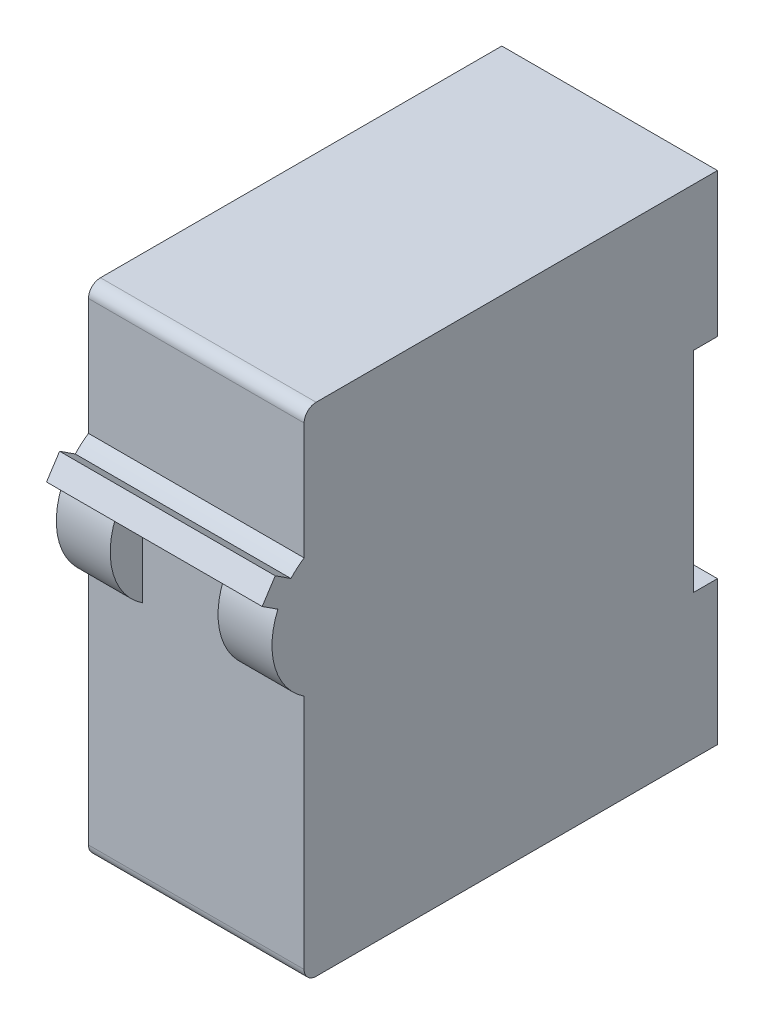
ISO-10303-21;
HEADER;
FILE_DESCRIPTION(('STEP AP214'),'2;1');
FILE_NAME('part.step','',(''),(''),'','','');
FILE_SCHEMA(('AUTOMOTIVE_DESIGN { 1 0 10303 214 1 1 1 1 }'));
ENDSEC;
DATA;
#1=APPLICATION_CONTEXT('core data for automotive mechanical design processes');
#2=APPLICATION_PROTOCOL_DEFINITION('international standard','automotive_design',2000,#1);
#3=PRODUCT_CONTEXT('',#1,'mechanical');
#4=PRODUCT('Part','Part','',(#3));
#5=PRODUCT_RELATED_PRODUCT_CATEGORY('part','',(#4));
#6=PRODUCT_DEFINITION_FORMATION('','',#4);
#7=PRODUCT_DEFINITION_CONTEXT('part definition',#1,'design');
#8=PRODUCT_DEFINITION('design','',#6,#7);
#9=PRODUCT_DEFINITION_SHAPE('','',#8);
#10=(LENGTH_UNIT() NAMED_UNIT(*) SI_UNIT(.MILLI.,.METRE.));
#11=(NAMED_UNIT(*) PLANE_ANGLE_UNIT() SI_UNIT($,.RADIAN.));
#12=(NAMED_UNIT(*) SI_UNIT($,.STERADIAN.) SOLID_ANGLE_UNIT());
#13=UNCERTAINTY_MEASURE_WITH_UNIT(LENGTH_MEASURE(1.E-05),#10,'distance_accuracy_value','');
#14=(GEOMETRIC_REPRESENTATION_CONTEXT(3) GLOBAL_UNCERTAINTY_ASSIGNED_CONTEXT((#13)) GLOBAL_UNIT_ASSIGNED_CONTEXT((#10,
#11,#12)) REPRESENTATION_CONTEXT('',''));
#15=CARTESIAN_POINT('',(0.,0.,0.));
#16=DIRECTION('',(0.,0.,1.));
#17=DIRECTION('',(1.,0.,0.));
#18=AXIS2_PLACEMENT_3D('',#15,#16,#17);
#19=CARTESIAN_POINT('',(36.,51.5,62.3667504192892));
#20=DIRECTION('',(-1.,0.,0.));
#21=DIRECTION('',(0.,0.,1.));
#22=AXIS2_PLACEMENT_3D('',#19,#20,#21);
#23=CYLINDRICAL_SURFACE('',#22,12.);
#24=CARTESIAN_POINT('',(27.,51.5,62.3667504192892));
#25=DIRECTION('',(-1.,0.,0.));
#26=DIRECTION('',(0.,-1.,0.));
#27=AXIS2_PLACEMENT_3D('',#24,#25,#26);
#28=CIRCLE('',#27,12.);
#29=CARTESIAN_POINT('',(27.,41.5,69.));
#30=VERTEX_POINT('',#29);
#31=CARTESIAN_POINT('',(27.,56.2669148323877,73.3793124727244));
#32=VERTEX_POINT('',#31);
#33=EDGE_CURVE('E11',#30,#32,#28,.T.);
#34=ORIENTED_EDGE('',*,*,#33,.F.);
#35=DIRECTION('',(-1.,0.,0.));
#36=VECTOR('',#35,1.);
#37=CARTESIAN_POINT('',(36.,41.5,69.));
#38=LINE('',#37,#36);
#39=CARTESIAN_POINT('',(36.,41.5,69.));
#40=VERTEX_POINT('',#39);
#41=EDGE_CURVE('E190',#40,#30,#38,.T.);
#42=ORIENTED_EDGE('',*,*,#41,.F.);
#43=CARTESIAN_POINT('',(36.,51.5,62.3667504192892));
#44=DIRECTION('',(1.,0.,0.));
#45=DIRECTION('',(0.,0.,-1.));
#46=AXIS2_PLACEMENT_3D('',#43,#44,#45);
#47=CIRCLE('',#46,12.);
#48=CARTESIAN_POINT('',(36.,56.2669148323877,73.3793124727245));
#49=VERTEX_POINT('',#48);
#50=EDGE_CURVE('E208',#49,#40,#47,.T.);
#51=ORIENTED_EDGE('',*,*,#50,.F.);
#52=DIRECTION('',(-1.,0.,0.));
#53=VECTOR('',#52,1.);
#54=CARTESIAN_POINT('',(36.,56.2669148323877,73.3793124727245));
#55=LINE('',#54,#53);
#56=EDGE_CURVE('E275',#49,#32,#55,.T.);
#57=ORIENTED_EDGE('',*,*,#56,.T.);
#58=EDGE_LOOP('',(#34,#42,#51,#57));
#59=FACE_BOUND('',#58,.T.);
#60=ADVANCED_FACE('F39',(#59),#23,.T.);
#61=CARTESIAN_POINT('',(9.,51.5,62.3667504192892));
#62=DIRECTION('',(1.,0.,0.));
#63=DIRECTION('',(0.,0.,-1.));
#64=AXIS2_PLACEMENT_3D('',#61,#62,#63);
#65=CIRCLE('',#64,12.);
#66=CARTESIAN_POINT('',(9.,56.2669148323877,73.3793124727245));
#67=VERTEX_POINT('',#66);
#68=CARTESIAN_POINT('',(9.,41.5,69.));
#69=VERTEX_POINT('',#68);
#70=EDGE_CURVE('E47',#67,#69,#65,.T.);
#71=ORIENTED_EDGE('',*,*,#70,.F.);
#72=CARTESIAN_POINT('',(0.,56.2669148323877,73.3793124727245));
#73=VERTEX_POINT('',#72);
#74=EDGE_CURVE('E274',#67,#73,#55,.T.);
#75=ORIENTED_EDGE('',*,*,#74,.T.);
#76=CARTESIAN_POINT('',(0.,51.5,62.3667504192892));
#77=DIRECTION('',(1.,0.,0.));
#78=DIRECTION('',(0.,0.,-1.));
#79=AXIS2_PLACEMENT_3D('',#76,#77,#78);
#80=CIRCLE('',#79,12.);
#81=CARTESIAN_POINT('',(0.,41.5,69.));
#82=VERTEX_POINT('',#81);
#83=EDGE_CURVE('E239',#73,#82,#80,.T.);
#84=ORIENTED_EDGE('',*,*,#83,.T.);
#85=EDGE_CURVE('E272',#69,#82,#38,.T.);
#86=ORIENTED_EDGE('',*,*,#85,.F.);
#87=EDGE_LOOP('',(#71,#75,#84,#86));
#88=FACE_BOUND('',#87,.T.);
#89=ADVANCED_FACE('F313',(#88),#23,.T.);
#90=CARTESIAN_POINT('',(36.,83.,0.));
#91=DIRECTION('',(0.,-1.,0.));
#92=DIRECTION('',(0.,0.,-1.));
#93=AXIS2_PLACEMENT_3D('',#90,#91,#92);
#94=PLANE('',#93);
#95=DIRECTION('',(0.,0.,1.));
#96=VECTOR('',#95,1.);
#97=CARTESIAN_POINT('',(0.,83.,0.));
#98=LINE('',#97,#96);
#99=CARTESIAN_POINT('',(0.,83.,0.));
#100=VERTEX_POINT('',#99);
#101=CARTESIAN_POINT('',(0.,83.,67.));
#102=VERTEX_POINT('',#101);
#103=EDGE_CURVE('E178',#100,#102,#98,.T.);
#104=ORIENTED_EDGE('',*,*,#103,.T.);
#105=DIRECTION('',(-1.,0.,0.));
#106=VECTOR('',#105,1.);
#107=CARTESIAN_POINT('',(36.,83.,67.));
#108=LINE('',#107,#106);
#109=CARTESIAN_POINT('',(36.,83.,67.));
#110=VERTEX_POINT('',#109);
#111=EDGE_CURVE('E306',#102,#110,#108,.F.);
#112=ORIENTED_EDGE('',*,*,#111,.T.);
#113=DIRECTION('',(0.,0.,1.));
#114=VECTOR('',#113,1.);
#115=CARTESIAN_POINT('',(36.,83.,0.));
#116=LINE('',#115,#114);
#117=CARTESIAN_POINT('',(36.,83.,0.));
#118=VERTEX_POINT('',#117);
#119=EDGE_CURVE('E195',#118,#110,#116,.T.);
#120=ORIENTED_EDGE('',*,*,#119,.F.);
#121=DIRECTION('',(-1.,0.,0.));
#122=VECTOR('',#121,1.);
#123=CARTESIAN_POINT('',(36.,83.,0.));
#124=LINE('',#123,#122);
#125=EDGE_CURVE('E225',#118,#100,#124,.T.);
#126=ORIENTED_EDGE('',*,*,#125,.T.);
#127=EDGE_LOOP('',(#104,#112,#120,#126));
#128=FACE_BOUND('',#127,.T.);
#129=ADVANCED_FACE('F356',(#128),#94,.F.);
#130=CARTESIAN_POINT('',(36.,83.,69.));
#131=DIRECTION('',(0.,0.,-1.));
#132=DIRECTION('',(0.,1.,0.));
#133=AXIS2_PLACEMENT_3D('',#130,#131,#132);
#134=PLANE('',#133);
#135=DIRECTION('',(0.,-1.,0.));
#136=VECTOR('',#135,1.);
#137=CARTESIAN_POINT('',(36.,83.,69.));
#138=LINE('',#137,#136);
#139=CARTESIAN_POINT('',(36.,81.,69.));
#140=VERTEX_POINT('',#139);
#141=CARTESIAN_POINT('',(36.,61.5,69.));
#142=VERTEX_POINT('',#141);
#143=EDGE_CURVE('E197',#140,#142,#138,.T.);
#144=ORIENTED_EDGE('',*,*,#143,.F.);
#145=DIRECTION('',(-1.,0.,0.));
#146=VECTOR('',#145,1.);
#147=CARTESIAN_POINT('',(36.,81.,69.));
#148=LINE('',#147,#146);
#149=CARTESIAN_POINT('',(0.,81.,69.));
#150=VERTEX_POINT('',#149);
#151=EDGE_CURVE('E303',#140,#150,#148,.T.);
#152=ORIENTED_EDGE('',*,*,#151,.T.);
#153=DIRECTION('',(0.,-1.,0.));
#154=VECTOR('',#153,1.);
#155=CARTESIAN_POINT('',(0.,83.,69.));
#156=LINE('',#155,#154);
#157=CARTESIAN_POINT('',(0.,61.5,69.));
#158=VERTEX_POINT('',#157);
#159=EDGE_CURVE('E228',#150,#158,#156,.T.);
#160=ORIENTED_EDGE('',*,*,#159,.T.);
#161=DIRECTION('',(-1.,0.,0.));
#162=VECTOR('',#161,1.);
#163=CARTESIAN_POINT('',(36.,61.5,69.));
#164=LINE('',#163,#162);
#165=EDGE_CURVE('E288',#142,#158,#164,.T.);
#166=ORIENTED_EDGE('',*,*,#165,.F.);
#167=EDGE_LOOP('',(#144,#152,#160,#166));
#168=FACE_BOUND('',#167,.T.);
#169=ADVANCED_FACE('F362',(#168),#134,.F.);
#170=CARTESIAN_POINT('',(36.,51.5,62.3667504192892));
#171=DIRECTION('',(-1.,0.,0.));
#172=DIRECTION('',(0.,0.,1.));
#173=AXIS2_PLACEMENT_3D('',#170,#171,#172);
#174=CYLINDRICAL_SURFACE('',#173,12.);
#175=CARTESIAN_POINT('',(0.,51.5,62.3667504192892));
#176=DIRECTION('',(1.,0.,0.));
#177=DIRECTION('',(0.,0.,1.));
#178=AXIS2_PLACEMENT_3D('',#175,#176,#177);
#179=CIRCLE('',#178,12.);
#180=CARTESIAN_POINT('',(0.,59.6215971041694,71.2007563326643));
#181=VERTEX_POINT('',#180);
#182=EDGE_CURVE('E230',#158,#181,#179,.T.);
#183=ORIENTED_EDGE('',*,*,#182,.T.);
#184=DIRECTION('',(-1.,0.,0.));
#185=VECTOR('',#184,1.);
#186=CARTESIAN_POINT('',(36.,59.6215971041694,71.2007563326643));
#187=LINE('',#186,#185);
#188=CARTESIAN_POINT('',(36.,59.6215971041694,71.2007563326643));
#189=VERTEX_POINT('',#188);
#190=EDGE_CURVE('E285',#189,#181,#187,.T.);
#191=ORIENTED_EDGE('',*,*,#190,.F.);
#192=CARTESIAN_POINT('',(36.,51.5,62.3667504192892));
#193=DIRECTION('',(1.,0.,0.));
#194=DIRECTION('',(0.,0.,1.));
#195=AXIS2_PLACEMENT_3D('',#192,#193,#194);
#196=CIRCLE('',#195,12.);
#197=EDGE_CURVE('E200',#142,#189,#196,.T.);
#198=ORIENTED_EDGE('',*,*,#197,.F.);
#199=ORIENTED_EDGE('',*,*,#165,.T.);
#200=EDGE_LOOP('',(#183,#191,#198,#199));
#201=FACE_BOUND('',#200,.T.);
#202=ADVANCED_FACE('F370',(#201),#174,.T.);
#203=CARTESIAN_POINT('',(36.,59.6215971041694,71.2007563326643));
#204=DIRECTION('',(0.,-0.838670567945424,0.544639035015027));
#205=DIRECTION('',(0.,-0.544639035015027,-0.838670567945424));
#206=AXIS2_PLACEMENT_3D('',#203,#204,#205);
#207=PLANE('',#206);
#208=DIRECTION('',(0.,0.544639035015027,0.838670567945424));
#209=VECTOR('',#208,1.);
#210=CARTESIAN_POINT('',(0.,59.6215971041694,71.2007563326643));
#211=LINE('',#210,#209);
#212=CARTESIAN_POINT('',(0.,61.3234914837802,73.8214438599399));
#213=VERTEX_POINT('',#212);
#214=EDGE_CURVE('E232',#181,#213,#211,.T.);
#215=ORIENTED_EDGE('',*,*,#214,.T.);
#216=DIRECTION('',(-1.,0.,0.));
#217=VECTOR('',#216,1.);
#218=CARTESIAN_POINT('',(36.,61.3234914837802,73.8214438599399));
#219=LINE('',#218,#217);
#220=CARTESIAN_POINT('',(36.,61.3234914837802,73.8214438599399));
#221=VERTEX_POINT('',#220);
#222=EDGE_CURVE('E282',#221,#213,#219,.T.);
#223=ORIENTED_EDGE('',*,*,#222,.F.);
#224=DIRECTION('',(0.,0.544639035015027,0.838670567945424));
#225=VECTOR('',#224,1.);
#226=CARTESIAN_POINT('',(36.,59.6215971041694,71.2007563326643));
#227=LINE('',#226,#225);
#228=EDGE_CURVE('E202',#189,#221,#227,.T.);
#229=ORIENTED_EDGE('',*,*,#228,.F.);
#230=ORIENTED_EDGE('',*,*,#190,.T.);
#231=EDGE_LOOP('',(#215,#223,#229,#230));
#232=FACE_BOUND('',#231,.T.);
#233=ADVANCED_FACE('F374',(#232),#207,.F.);
#234=CARTESIAN_POINT('',(36.,61.3234914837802,73.8214438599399));
#235=DIRECTION('',(0.,-0.544639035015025,-0.838670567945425));
#236=DIRECTION('',(0.,0.838670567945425,-0.544639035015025));
#237=AXIS2_PLACEMENT_3D('',#234,#235,#236);
#238=PLANE('',#237);
#239=DIRECTION('',(0.,-0.838670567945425,0.544639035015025));
#240=VECTOR('',#239,1.);
#241=CARTESIAN_POINT('',(0.,61.3234914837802,73.8214438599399));
#242=LINE('',#241,#240);
#243=CARTESIAN_POINT('',(0.,57.9688092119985,76.));
#244=VERTEX_POINT('',#243);
#245=EDGE_CURVE('E234',#213,#244,#242,.T.);
#246=ORIENTED_EDGE('',*,*,#245,.T.);
#247=DIRECTION('',(-1.,0.,0.));
#248=VECTOR('',#247,1.);
#249=CARTESIAN_POINT('',(36.,57.9688092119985,76.));
#250=LINE('',#249,#248);
#251=CARTESIAN_POINT('',(36.,57.9688092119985,76.));
#252=VERTEX_POINT('',#251);
#253=EDGE_CURVE('E278',#252,#244,#250,.T.);
#254=ORIENTED_EDGE('',*,*,#253,.F.);
#255=DIRECTION('',(0.,-0.838670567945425,0.544639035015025));
#256=VECTOR('',#255,1.);
#257=CARTESIAN_POINT('',(36.,61.3234914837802,73.8214438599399));
#258=LINE('',#257,#256);
#259=EDGE_CURVE('E204',#221,#252,#258,.T.);
#260=ORIENTED_EDGE('',*,*,#259,.F.);
#261=ORIENTED_EDGE('',*,*,#222,.T.);
#262=EDGE_LOOP('',(#246,#254,#260,#261));
#263=FACE_BOUND('',#262,.T.);
#264=ADVANCED_FACE('F381',(#263),#238,.F.);
#265=CARTESIAN_POINT('',(36.,57.9688092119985,76.));
#266=DIRECTION('',(0.,0.838670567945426,-0.544639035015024));
#267=DIRECTION('',(0.,0.544639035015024,0.838670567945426));
#268=AXIS2_PLACEMENT_3D('',#265,#266,#267);
#269=PLANE('',#268);
#270=DIRECTION('',(0.,-0.544639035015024,-0.838670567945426));
#271=VECTOR('',#270,1.);
#272=CARTESIAN_POINT('',(0.,57.9688092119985,76.));
#273=LINE('',#272,#271);
#274=EDGE_CURVE('E236',#244,#73,#273,.T.);
#275=ORIENTED_EDGE('',*,*,#274,.T.);
#276=ORIENTED_EDGE('',*,*,#74,.F.);
#277=EDGE_CURVE('E279',#32,#67,#55,.T.);
#278=ORIENTED_EDGE('',*,*,#277,.F.);
#279=ORIENTED_EDGE('',*,*,#56,.F.);
#280=DIRECTION('',(0.,-0.544639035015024,-0.838670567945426));
#281=VECTOR('',#280,1.);
#282=CARTESIAN_POINT('',(36.,57.9688092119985,76.));
#283=LINE('',#282,#281);
#284=EDGE_CURVE('E206',#252,#49,#283,.T.);
#285=ORIENTED_EDGE('',*,*,#284,.F.);
#286=ORIENTED_EDGE('',*,*,#253,.T.);
#287=EDGE_LOOP('',(#275,#276,#278,#279,#285,#286));
#288=FACE_BOUND('',#287,.T.);
#289=ADVANCED_FACE('F384',(#288),#269,.F.);
#290=CARTESIAN_POINT('',(36.,41.5,69.));
#291=DIRECTION('',(0.,0.,-1.));
#292=DIRECTION('',(-1.,0.,0.));
#293=AXIS2_PLACEMENT_3D('',#290,#291,#292);
#294=PLANE('',#293);
#295=DIRECTION('',(0.,-1.,0.));
#296=VECTOR('',#295,1.);
#297=CARTESIAN_POINT('',(0.,41.5,69.));
#298=LINE('',#297,#296);
#299=CARTESIAN_POINT('',(0.,2.00000000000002,69.));
#300=VERTEX_POINT('',#299);
#301=EDGE_CURVE('E242',#82,#300,#298,.T.);
#302=ORIENTED_EDGE('',*,*,#301,.T.);
#303=DIRECTION('',(-1.,0.,0.));
#304=VECTOR('',#303,1.);
#305=CARTESIAN_POINT('',(36.,2.,69.));
#306=LINE('',#305,#304);
#307=CARTESIAN_POINT('',(36.,2.00000000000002,69.));
#308=VERTEX_POINT('',#307);
#309=EDGE_CURVE('E298',#300,#308,#306,.F.);
#310=ORIENTED_EDGE('',*,*,#309,.T.);
#311=DIRECTION('',(0.,-1.,0.));
#312=VECTOR('',#311,1.);
#313=CARTESIAN_POINT('',(36.,41.5,69.));
#314=LINE('',#313,#312);
#315=EDGE_CURVE('E210',#40,#308,#314,.T.);
#316=ORIENTED_EDGE('',*,*,#315,.F.);
#317=ORIENTED_EDGE('',*,*,#41,.T.);
#318=DIRECTION('',(0.,1.,0.));
#319=VECTOR('',#318,1.);
#320=CARTESIAN_POINT('',(27.,41.5,69.));
#321=LINE('',#320,#319);
#322=CARTESIAN_POINT('',(27.,56.2669148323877,69.));
#323=VERTEX_POINT('',#322);
#324=EDGE_CURVE('E174',#30,#323,#321,.T.);
#325=ORIENTED_EDGE('',*,*,#324,.T.);
#326=DIRECTION('',(-1.,0.,0.));
#327=VECTOR('',#326,1.);
#328=CARTESIAN_POINT('',(27.,56.2669148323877,69.));
#329=LINE('',#328,#327);
#330=CARTESIAN_POINT('',(9.,56.2669148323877,69.));
#331=VERTEX_POINT('',#330);
#332=EDGE_CURVE('E181',#323,#331,#329,.T.);
#333=ORIENTED_EDGE('',*,*,#332,.T.);
#334=DIRECTION('',(0.,-1.,0.));
#335=VECTOR('',#334,1.);
#336=CARTESIAN_POINT('',(9.,41.5,69.));
#337=LINE('',#336,#335);
#338=EDGE_CURVE('E54',#331,#69,#337,.T.);
#339=ORIENTED_EDGE('',*,*,#338,.T.);
#340=ORIENTED_EDGE('',*,*,#85,.T.);
#341=EDGE_LOOP('',(#302,#310,#316,#317,#325,#333,#339,#340));
#342=FACE_BOUND('',#341,.T.);
#343=ADVANCED_FACE('F187',(#342),#294,.F.);
#344=CARTESIAN_POINT('',(36.,0.,69.));
#345=DIRECTION('',(0.,1.,0.));
#346=DIRECTION('',(0.,0.,1.));
#347=AXIS2_PLACEMENT_3D('',#344,#345,#346);
#348=PLANE('',#347);
#349=DIRECTION('',(0.,0.,-1.));
#350=VECTOR('',#349,1.);
#351=CARTESIAN_POINT('',(36.,0.,69.));
#352=LINE('',#351,#350);
#353=CARTESIAN_POINT('',(36.,0.,67.));
#354=VERTEX_POINT('',#353);
#355=CARTESIAN_POINT('',(36.,0.,0.));
#356=VERTEX_POINT('',#355);
#357=EDGE_CURVE('E213',#354,#356,#352,.T.);
#358=ORIENTED_EDGE('',*,*,#357,.F.);
#359=DIRECTION('',(-1.,0.,0.));
#360=VECTOR('',#359,1.);
#361=CARTESIAN_POINT('',(36.,0.,67.));
#362=LINE('',#361,#360);
#363=CARTESIAN_POINT('',(0.,0.,67.));
#364=VERTEX_POINT('',#363);
#365=EDGE_CURVE('E291',#354,#364,#362,.T.);
#366=ORIENTED_EDGE('',*,*,#365,.T.);
#367=DIRECTION('',(0.,0.,-1.));
#368=VECTOR('',#367,1.);
#369=CARTESIAN_POINT('',(0.,0.,69.));
#370=LINE('',#369,#368);
#371=CARTESIAN_POINT('',(0.,0.,0.));
#372=VERTEX_POINT('',#371);
#373=EDGE_CURVE('E244',#364,#372,#370,.T.);
#374=ORIENTED_EDGE('',*,*,#373,.T.);
#375=DIRECTION('',(-1.,0.,0.));
#376=VECTOR('',#375,1.);
#377=CARTESIAN_POINT('',(36.,0.,0.));
#378=LINE('',#377,#376);
#379=EDGE_CURVE('E269',#356,#372,#378,.T.);
#380=ORIENTED_EDGE('',*,*,#379,.F.);
#381=EDGE_LOOP('',(#358,#366,#374,#380));
#382=FACE_BOUND('',#381,.T.);
#383=ADVANCED_FACE('F326',(#382),#348,.F.);
#384=CARTESIAN_POINT('',(36.,24.,0.));
#385=DIRECTION('',(0.,0.,1.));
#386=DIRECTION('',(0.,-1.,0.));
#387=AXIS2_PLACEMENT_3D('',#384,#385,#386);
#388=PLANE('',#387);
#389=DIRECTION('',(0.,1.,0.));
#390=VECTOR('',#389,1.);
#391=CARTESIAN_POINT('',(0.,24.,0.));
#392=LINE('',#391,#390);
#393=CARTESIAN_POINT('',(0.,24.,0.));
#394=VERTEX_POINT('',#393);
#395=EDGE_CURVE('E246',#372,#394,#392,.T.);
#396=ORIENTED_EDGE('',*,*,#395,.T.);
#397=DIRECTION('',(-1.,0.,0.));
#398=VECTOR('',#397,1.);
#399=CARTESIAN_POINT('',(36.,24.,0.));
#400=LINE('',#399,#398);
#401=CARTESIAN_POINT('',(36.,24.,0.));
#402=VERTEX_POINT('',#401);
#403=EDGE_CURVE('E266',#402,#394,#400,.T.);
#404=ORIENTED_EDGE('',*,*,#403,.F.);
#405=DIRECTION('',(0.,1.,0.));
#406=VECTOR('',#405,1.);
#407=CARTESIAN_POINT('',(36.,24.,0.));
#408=LINE('',#407,#406);
#409=EDGE_CURVE('E215',#356,#402,#408,.T.);
#410=ORIENTED_EDGE('',*,*,#409,.F.);
#411=ORIENTED_EDGE('',*,*,#379,.T.);
#412=EDGE_LOOP('',(#396,#404,#410,#411));
#413=FACE_BOUND('',#412,.T.);
#414=ADVANCED_FACE('F332',(#413),#388,.F.);
#415=CARTESIAN_POINT('',(36.,24.,4.));
#416=DIRECTION('',(0.,-1.,0.));
#417=DIRECTION('',(0.,0.,-1.));
#418=AXIS2_PLACEMENT_3D('',#415,#416,#417);
#419=PLANE('',#418);
#420=DIRECTION('',(0.,0.,1.));
#421=VECTOR('',#420,1.);
#422=CARTESIAN_POINT('',(0.,24.,4.));
#423=LINE('',#422,#421);
#424=CARTESIAN_POINT('',(0.,24.,4.));
#425=VERTEX_POINT('',#424);
#426=EDGE_CURVE('E248',#394,#425,#423,.T.);
#427=ORIENTED_EDGE('',*,*,#426,.T.);
#428=DIRECTION('',(-1.,0.,0.));
#429=VECTOR('',#428,1.);
#430=CARTESIAN_POINT('',(36.,24.,4.));
#431=LINE('',#430,#429);
#432=CARTESIAN_POINT('',(36.,24.,4.));
#433=VERTEX_POINT('',#432);
#434=EDGE_CURVE('E263',#433,#425,#431,.T.);
#435=ORIENTED_EDGE('',*,*,#434,.F.);
#436=DIRECTION('',(0.,0.,1.));
#437=VECTOR('',#436,1.);
#438=CARTESIAN_POINT('',(36.,24.,4.));
#439=LINE('',#438,#437);
#440=EDGE_CURVE('E217',#402,#433,#439,.T.);
#441=ORIENTED_EDGE('',*,*,#440,.F.);
#442=ORIENTED_EDGE('',*,*,#403,.T.);
#443=EDGE_LOOP('',(#427,#435,#441,#442));
#444=FACE_BOUND('',#443,.T.);
#445=ADVANCED_FACE('F338',(#444),#419,.F.);
#446=CARTESIAN_POINT('',(36.,59.,4.00000000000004));
#447=DIRECTION('',(0.,0.,1.));
#448=DIRECTION('',(0.,-1.,0.));
#449=AXIS2_PLACEMENT_3D('',#446,#447,#448);
#450=PLANE('',#449);
#451=DIRECTION('',(0.,1.,0.));
#452=VECTOR('',#451,1.);
#453=CARTESIAN_POINT('',(0.,59.,4.00000000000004));
#454=LINE('',#453,#452);
#455=CARTESIAN_POINT('',(0.,59.,4.00000000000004));
#456=VERTEX_POINT('',#455);
#457=EDGE_CURVE('E250',#425,#456,#454,.T.);
#458=ORIENTED_EDGE('',*,*,#457,.T.);
#459=DIRECTION('',(-1.,0.,0.));
#460=VECTOR('',#459,1.);
#461=CARTESIAN_POINT('',(36.,59.,4.00000000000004));
#462=LINE('',#461,#460);
#463=CARTESIAN_POINT('',(36.,59.,4.00000000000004));
#464=VERTEX_POINT('',#463);
#465=EDGE_CURVE('E260',#464,#456,#462,.T.);
#466=ORIENTED_EDGE('',*,*,#465,.F.);
#467=DIRECTION('',(0.,1.,0.));
#468=VECTOR('',#467,1.);
#469=CARTESIAN_POINT('',(36.,59.,4.00000000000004));
#470=LINE('',#469,#468);
#471=EDGE_CURVE('E219',#433,#464,#470,.T.);
#472=ORIENTED_EDGE('',*,*,#471,.F.);
#473=ORIENTED_EDGE('',*,*,#434,.T.);
#474=EDGE_LOOP('',(#458,#466,#472,#473));
#475=FACE_BOUND('',#474,.T.);
#476=ADVANCED_FACE('F342',(#475),#450,.F.);
#477=CARTESIAN_POINT('',(36.,59.,0.));
#478=DIRECTION('',(0.,1.,0.));
#479=DIRECTION('',(0.,0.,1.));
#480=AXIS2_PLACEMENT_3D('',#477,#478,#479);
#481=PLANE('',#480);
#482=DIRECTION('',(0.,0.,-1.));
#483=VECTOR('',#482,1.);
#484=CARTESIAN_POINT('',(0.,59.,0.));
#485=LINE('',#484,#483);
#486=CARTESIAN_POINT('',(0.,59.,0.));
#487=VERTEX_POINT('',#486);
#488=EDGE_CURVE('E252',#456,#487,#485,.T.);
#489=ORIENTED_EDGE('',*,*,#488,.T.);
#490=DIRECTION('',(-1.,0.,0.));
#491=VECTOR('',#490,1.);
#492=CARTESIAN_POINT('',(36.,59.,0.));
#493=LINE('',#492,#491);
#494=CARTESIAN_POINT('',(36.,59.,0.));
#495=VERTEX_POINT('',#494);
#496=EDGE_CURVE('E257',#495,#487,#493,.T.);
#497=ORIENTED_EDGE('',*,*,#496,.F.);
#498=DIRECTION('',(0.,0.,-1.));
#499=VECTOR('',#498,1.);
#500=CARTESIAN_POINT('',(36.,59.,0.));
#501=LINE('',#500,#499);
#502=EDGE_CURVE('E221',#464,#495,#501,.T.);
#503=ORIENTED_EDGE('',*,*,#502,.F.);
#504=ORIENTED_EDGE('',*,*,#465,.T.);
#505=EDGE_LOOP('',(#489,#497,#503,#504));
#506=FACE_BOUND('',#505,.T.);
#507=ADVANCED_FACE('F347',(#506),#481,.F.);
#508=CARTESIAN_POINT('',(36.,83.,0.));
#509=DIRECTION('',(0.,0.,1.));
#510=DIRECTION('',(0.,-1.,0.));
#511=AXIS2_PLACEMENT_3D('',#508,#509,#510);
#512=PLANE('',#511);
#513=DIRECTION('',(0.,1.,0.));
#514=VECTOR('',#513,1.);
#515=CARTESIAN_POINT('',(0.,83.,0.));
#516=LINE('',#515,#514);
#517=EDGE_CURVE('E198',#487,#100,#516,.T.);
#518=ORIENTED_EDGE('',*,*,#517,.T.);
#519=ORIENTED_EDGE('',*,*,#125,.F.);
#520=DIRECTION('',(0.,1.,0.));
#521=VECTOR('',#520,1.);
#522=CARTESIAN_POINT('',(36.,83.,0.));
#523=LINE('',#522,#521);
#524=EDGE_CURVE('E223',#495,#118,#523,.T.);
#525=ORIENTED_EDGE('',*,*,#524,.F.);
#526=ORIENTED_EDGE('',*,*,#496,.T.);
#527=EDGE_LOOP('',(#518,#519,#525,#526));
#528=FACE_BOUND('',#527,.T.);
#529=ADVANCED_FACE('F352',(#528),#512,.F.);
#530=CARTESIAN_POINT('',(36.,51.5,62.3667504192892));
#531=DIRECTION('',(-1.,0.,0.));
#532=DIRECTION('',(0.,0.,1.));
#533=AXIS2_PLACEMENT_3D('',#530,#531,#532);
#534=PLANE('',#533);
#535=ORIENTED_EDGE('',*,*,#315,.T.);
#536=CARTESIAN_POINT('',(36.,2.,67.));
#537=DIRECTION('',(-1.,0.,0.));
#538=DIRECTION('',(0.,0.,1.));
#539=AXIS2_PLACEMENT_3D('',#536,#537,#538);
#540=CIRCLE('',#539,2.);
#541=EDGE_CURVE('E301',#308,#354,#540,.F.);
#542=ORIENTED_EDGE('',*,*,#541,.T.);
#543=ORIENTED_EDGE('',*,*,#357,.T.);
#544=ORIENTED_EDGE('',*,*,#409,.T.);
#545=ORIENTED_EDGE('',*,*,#440,.T.);
#546=ORIENTED_EDGE('',*,*,#471,.T.);
#547=ORIENTED_EDGE('',*,*,#502,.T.);
#548=ORIENTED_EDGE('',*,*,#524,.T.);
#549=ORIENTED_EDGE('',*,*,#119,.T.);
#550=CARTESIAN_POINT('',(36.,81.,67.));
#551=DIRECTION('',(-1.,0.,0.));
#552=DIRECTION('',(0.,0.,1.));
#553=AXIS2_PLACEMENT_3D('',#550,#551,#552);
#554=CIRCLE('',#553,2.);
#555=EDGE_CURVE('E62',#110,#140,#554,.F.);
#556=ORIENTED_EDGE('',*,*,#555,.T.);
#557=ORIENTED_EDGE('',*,*,#143,.T.);
#558=ORIENTED_EDGE('',*,*,#197,.T.);
#559=ORIENTED_EDGE('',*,*,#228,.T.);
#560=ORIENTED_EDGE('',*,*,#259,.T.);
#561=ORIENTED_EDGE('',*,*,#284,.T.);
#562=ORIENTED_EDGE('',*,*,#50,.T.);
#563=EDGE_LOOP('',(#535,#542,#543,#544,#545,#546,#547,#548,#549,#556,#557,#558,#559,#560,#561,#562));
#564=FACE_BOUND('',#563,.T.);
#565=ADVANCED_FACE('F323',(#564),#534,.F.);
#566=CARTESIAN_POINT('',(0.,51.5,62.3667504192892));
#567=DIRECTION('',(-1.,0.,0.));
#568=DIRECTION('',(0.,0.,1.));
#569=AXIS2_PLACEMENT_3D('',#566,#567,#568);
#570=PLANE('',#569);
#571=ORIENTED_EDGE('',*,*,#373,.F.);
#572=CARTESIAN_POINT('',(0.,2.,67.));
#573=DIRECTION('',(-1.,0.,0.));
#574=DIRECTION('',(0.,0.,1.));
#575=AXIS2_PLACEMENT_3D('',#572,#573,#574);
#576=CIRCLE('',#575,2.);
#577=EDGE_CURVE('E296',#364,#300,#576,.T.);
#578=ORIENTED_EDGE('',*,*,#577,.T.);
#579=ORIENTED_EDGE('',*,*,#301,.F.);
#580=ORIENTED_EDGE('',*,*,#83,.F.);
#581=ORIENTED_EDGE('',*,*,#274,.F.);
#582=ORIENTED_EDGE('',*,*,#245,.F.);
#583=ORIENTED_EDGE('',*,*,#214,.F.);
#584=ORIENTED_EDGE('',*,*,#182,.F.);
#585=ORIENTED_EDGE('',*,*,#159,.F.);
#586=CARTESIAN_POINT('',(0.,81.,67.));
#587=DIRECTION('',(-1.,0.,0.));
#588=DIRECTION('',(0.,0.,1.));
#589=AXIS2_PLACEMENT_3D('',#586,#587,#588);
#590=CIRCLE('',#589,2.);
#591=EDGE_CURVE('E294',#150,#102,#590,.T.);
#592=ORIENTED_EDGE('',*,*,#591,.T.);
#593=ORIENTED_EDGE('',*,*,#103,.F.);
#594=ORIENTED_EDGE('',*,*,#517,.F.);
#595=ORIENTED_EDGE('',*,*,#488,.F.);
#596=ORIENTED_EDGE('',*,*,#457,.F.);
#597=ORIENTED_EDGE('',*,*,#426,.F.);
#598=ORIENTED_EDGE('',*,*,#395,.F.);
#599=EDGE_LOOP('',(#571,#578,#579,#580,#581,#582,#583,#584,#585,#592,#593,#594,#595,#596,#597,#598));
#600=FACE_BOUND('',#599,.T.);
#601=ADVANCED_FACE('F365',(#600),#570,.T.);
#602=CARTESIAN_POINT('',(36.,2.,67.));
#603=DIRECTION('',(-1.,0.,0.));
#604=DIRECTION('',(0.,0.,1.));
#605=AXIS2_PLACEMENT_3D('',#602,#603,#604);
#606=CYLINDRICAL_SURFACE('',#605,2.);
#607=ORIENTED_EDGE('',*,*,#541,.F.);
#608=ORIENTED_EDGE('',*,*,#309,.F.);
#609=ORIENTED_EDGE('',*,*,#577,.F.);
#610=ORIENTED_EDGE('',*,*,#365,.F.);
#611=EDGE_LOOP('',(#607,#608,#609,#610));
#612=FACE_BOUND('',#611,.T.);
#613=ADVANCED_FACE('F320',(#612),#606,.T.);
#614=CARTESIAN_POINT('',(36.,81.,67.));
#615=DIRECTION('',(-1.,0.,0.));
#616=DIRECTION('',(0.,0.,1.));
#617=AXIS2_PLACEMENT_3D('',#614,#615,#616);
#618=CYLINDRICAL_SURFACE('',#617,2.);
#619=ORIENTED_EDGE('',*,*,#555,.F.);
#620=ORIENTED_EDGE('',*,*,#111,.F.);
#621=ORIENTED_EDGE('',*,*,#591,.F.);
#622=ORIENTED_EDGE('',*,*,#151,.F.);
#623=EDGE_LOOP('',(#619,#620,#621,#622));
#624=FACE_BOUND('',#623,.T.);
#625=ADVANCED_FACE('F41',(#624),#618,.T.);
#626=CARTESIAN_POINT('',(27.,41.5,76.));
#627=DIRECTION('',(-1.,0.,0.));
#628=DIRECTION('',(0.,-1.,0.));
#629=AXIS2_PLACEMENT_3D('',#626,#627,#628);
#630=PLANE('',#629);
#631=ORIENTED_EDGE('',*,*,#33,.T.);
#632=DIRECTION('',(0.,0.,-1.));
#633=VECTOR('',#632,1.);
#634=CARTESIAN_POINT('',(27.,56.2669148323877,76.));
#635=LINE('',#634,#633);
#636=EDGE_CURVE('E170',#32,#323,#635,.T.);
#637=ORIENTED_EDGE('',*,*,#636,.T.);
#638=ORIENTED_EDGE('',*,*,#324,.F.);
#639=EDGE_LOOP('',(#631,#637,#638));
#640=FACE_BOUND('',#639,.T.);
#641=ADVANCED_FACE('F172',(#640),#630,.T.);
#642=CARTESIAN_POINT('',(27.,56.2669148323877,76.));
#643=DIRECTION('',(0.,-1.,0.));
#644=DIRECTION('',(1.,0.,0.));
#645=AXIS2_PLACEMENT_3D('',#642,#643,#644);
#646=PLANE('',#645);
#647=ORIENTED_EDGE('',*,*,#277,.T.);
#648=DIRECTION('',(0.,0.,-1.));
#649=VECTOR('',#648,1.);
#650=CARTESIAN_POINT('',(9.,56.2669148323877,76.));
#651=LINE('',#650,#649);
#652=EDGE_CURVE('E179',#67,#331,#651,.T.);
#653=ORIENTED_EDGE('',*,*,#652,.T.);
#654=ORIENTED_EDGE('',*,*,#332,.F.);
#655=ORIENTED_EDGE('',*,*,#636,.F.);
#656=EDGE_LOOP('',(#647,#653,#654,#655));
#657=FACE_BOUND('',#656,.T.);
#658=ADVANCED_FACE('F182',(#657),#646,.T.);
#659=CARTESIAN_POINT('',(9.,41.5,76.));
#660=DIRECTION('',(1.,0.,0.));
#661=DIRECTION('',(0.,0.,-1.));
#662=AXIS2_PLACEMENT_3D('',#659,#660,#661);
#663=PLANE('',#662);
#664=ORIENTED_EDGE('',*,*,#70,.T.);
#665=ORIENTED_EDGE('',*,*,#338,.F.);
#666=ORIENTED_EDGE('',*,*,#652,.F.);
#667=EDGE_LOOP('',(#664,#665,#666));
#668=FACE_BOUND('',#667,.T.);
#669=ADVANCED_FACE('F310',(#668),#663,.T.);
#670=CLOSED_SHELL('',(#60,#89,#129,#169,#202,#233,#264,#289,#343,#383,#414,#445,#476,#507,#529,
#565,#601,#613,#625,#641,#658,#669));
#671=MANIFOLD_SOLID_BREP('B2',#670);
#672=ADVANCED_BREP_SHAPE_REPRESENTATION('',(#18,#671),#14);
#673=SHAPE_DEFINITION_REPRESENTATION(#9,#672);
ENDSEC;
END-ISO-10303-21;
